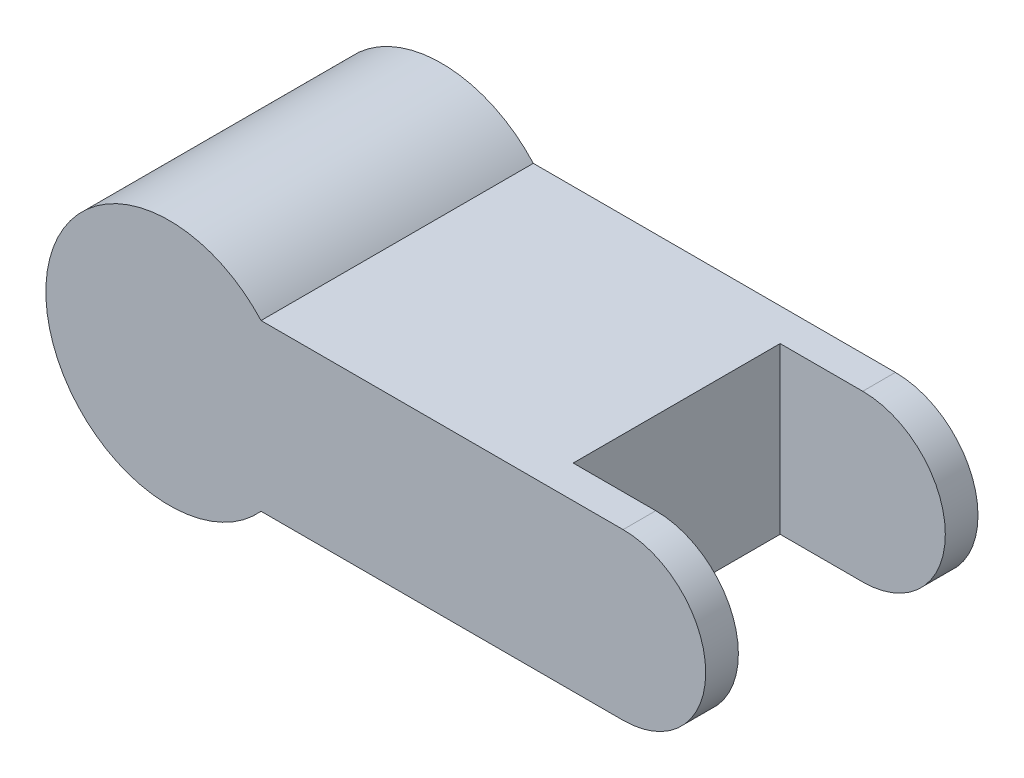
ISO-10303-21;
HEADER;
FILE_DESCRIPTION(('STEP AP214'),'2;1');
FILE_NAME('part.step','',(''),(''),'','','');
FILE_SCHEMA(('AUTOMOTIVE_DESIGN { 1 0 10303 214 1 1 1 1 }'));
ENDSEC;
DATA;
#1=APPLICATION_CONTEXT('core data for automotive mechanical design processes');
#2=APPLICATION_PROTOCOL_DEFINITION('international standard','automotive_design',2000,#1);
#3=PRODUCT_CONTEXT('',#1,'mechanical');
#4=PRODUCT('Part','Part','',(#3));
#5=PRODUCT_RELATED_PRODUCT_CATEGORY('part','',(#4));
#6=PRODUCT_DEFINITION_FORMATION('','',#4);
#7=PRODUCT_DEFINITION_CONTEXT('part definition',#1,'design');
#8=PRODUCT_DEFINITION('design','',#6,#7);
#9=PRODUCT_DEFINITION_SHAPE('','',#8);
#10=(LENGTH_UNIT() NAMED_UNIT(*) SI_UNIT(.MILLI.,.METRE.));
#11=(NAMED_UNIT(*) PLANE_ANGLE_UNIT() SI_UNIT($,.RADIAN.));
#12=(NAMED_UNIT(*) SI_UNIT($,.STERADIAN.) SOLID_ANGLE_UNIT());
#13=UNCERTAINTY_MEASURE_WITH_UNIT(LENGTH_MEASURE(1.E-05),#10,'distance_accuracy_value','');
#14=(GEOMETRIC_REPRESENTATION_CONTEXT(3) GLOBAL_UNCERTAINTY_ASSIGNED_CONTEXT((#13)) GLOBAL_UNIT_ASSIGNED_CONTEXT((#10,
#11,#12)) REPRESENTATION_CONTEXT('',''));
#15=CARTESIAN_POINT('',(0.,0.,0.));
#16=DIRECTION('',(0.,0.,1.));
#17=DIRECTION('',(1.,0.,0.));
#18=AXIS2_PLACEMENT_3D('',#15,#16,#17);
#19=CARTESIAN_POINT('',(250.,0.,-150.));
#20=DIRECTION('',(0.,0.,1.));
#21=DIRECTION('',(1.,0.,0.));
#22=AXIS2_PLACEMENT_3D('',#19,#20,#21);
#23=CYLINDRICAL_SURFACE('',#22,45.5);
#24=CARTESIAN_POINT('',(250.,0.,-132.));
#25=DIRECTION('',(0.,0.,-1.));
#26=DIRECTION('',(-1.,0.,0.));
#27=AXIS2_PLACEMENT_3D('',#24,#25,#26);
#28=CIRCLE('',#27,45.5);
#29=CARTESIAN_POINT('',(250.,-45.5,-132.));
#30=VERTEX_POINT('',#29);
#31=CARTESIAN_POINT('',(249.999999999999,45.5,-132.));
#32=VERTEX_POINT('',#31);
#33=EDGE_CURVE('E135',#30,#32,#28,.F.);
#34=ORIENTED_EDGE('',*,*,#33,.F.);
#35=DIRECTION('',(0.,0.,1.));
#36=VECTOR('',#35,1.);
#37=CARTESIAN_POINT('',(250.,-45.5,-150.));
#38=LINE('',#37,#36);
#39=CARTESIAN_POINT('',(250.,-45.5,-150.));
#40=VERTEX_POINT('',#39);
#41=EDGE_CURVE('E42',#40,#30,#38,.T.);
#42=ORIENTED_EDGE('',*,*,#41,.F.);
#43=CARTESIAN_POINT('',(250.,0.,-150.));
#44=DIRECTION('',(0.,0.,1.));
#45=DIRECTION('',(1.,0.,0.));
#46=AXIS2_PLACEMENT_3D('',#43,#44,#45);
#47=CIRCLE('',#46,45.5);
#48=CARTESIAN_POINT('',(249.999999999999,45.5,-150.));
#49=VERTEX_POINT('',#48);
#50=EDGE_CURVE('E138',#40,#49,#47,.T.);
#51=ORIENTED_EDGE('',*,*,#50,.T.);
#52=DIRECTION('',(0.,0.,1.));
#53=VECTOR('',#52,1.);
#54=CARTESIAN_POINT('',(249.999999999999,45.5,-150.));
#55=LINE('',#54,#53);
#56=EDGE_CURVE('E88',#49,#32,#55,.T.);
#57=ORIENTED_EDGE('',*,*,#56,.T.);
#58=EDGE_LOOP('',(#34,#42,#51,#57));
#59=FACE_BOUND('',#58,.T.);
#60=ADVANCED_FACE('F34',(#59),#23,.T.);
#61=CARTESIAN_POINT('',(250.,0.,-18.));
#62=DIRECTION('',(0.,0.,1.));
#63=DIRECTION('',(1.,0.,0.));
#64=AXIS2_PLACEMENT_3D('',#61,#62,#63);
#65=CIRCLE('',#64,45.5);
#66=CARTESIAN_POINT('',(249.999999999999,45.5,-18.));
#67=VERTEX_POINT('',#66);
#68=CARTESIAN_POINT('',(250.,-45.5,-18.));
#69=VERTEX_POINT('',#68);
#70=EDGE_CURVE('E131',#67,#69,#65,.F.);
#71=ORIENTED_EDGE('',*,*,#70,.F.);
#72=CARTESIAN_POINT('',(249.999999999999,45.5,0.));
#73=VERTEX_POINT('',#72);
#74=EDGE_CURVE('E148',#67,#73,#55,.T.);
#75=ORIENTED_EDGE('',*,*,#74,.T.);
#76=CARTESIAN_POINT('',(250.,0.,0.));
#77=DIRECTION('',(0.,0.,1.));
#78=DIRECTION('',(1.,0.,0.));
#79=AXIS2_PLACEMENT_3D('',#76,#77,#78);
#80=CIRCLE('',#79,45.5);
#81=CARTESIAN_POINT('',(250.,-45.5,0.));
#82=VERTEX_POINT('',#81);
#83=EDGE_CURVE('E137',#82,#73,#80,.T.);
#84=ORIENTED_EDGE('',*,*,#83,.F.);
#85=EDGE_CURVE('E80',#69,#82,#38,.T.);
#86=ORIENTED_EDGE('',*,*,#85,.F.);
#87=EDGE_LOOP('',(#71,#75,#84,#86));
#88=FACE_BOUND('',#87,.T.);
#89=ADVANCED_FACE('F36',(#88),#23,.T.);
#90=CARTESIAN_POINT('',(50.5346415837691,-45.5,-150.));
#91=DIRECTION('',(0.,-1.,0.));
#92=DIRECTION('',(1.,0.,0.));
#93=AXIS2_PLACEMENT_3D('',#90,#91,#92);
#94=PLANE('',#93);
#95=DIRECTION('',(-1.,0.,0.));
#96=VECTOR('',#95,1.);
#97=CARTESIAN_POINT('',(295.5,-45.5,-132.));
#98=LINE('',#97,#96);
#99=CARTESIAN_POINT('',(204.5,-45.5,-132.));
#100=VERTEX_POINT('',#99);
#101=EDGE_CURVE('E120',#30,#100,#98,.T.);
#102=ORIENTED_EDGE('',*,*,#101,.T.);
#103=DIRECTION('',(0.,0.,1.));
#104=VECTOR('',#103,1.);
#105=CARTESIAN_POINT('',(204.5,-45.5,-18.));
#106=LINE('',#105,#104);
#107=CARTESIAN_POINT('',(204.5,-45.5,-18.));
#108=VERTEX_POINT('',#107);
#109=EDGE_CURVE('E111',#100,#108,#106,.T.);
#110=ORIENTED_EDGE('',*,*,#109,.T.);
#111=DIRECTION('',(1.,0.,0.));
#112=VECTOR('',#111,1.);
#113=CARTESIAN_POINT('',(295.5,-45.5,-18.));
#114=LINE('',#113,#112);
#115=EDGE_CURVE('E130',#108,#69,#114,.T.);
#116=ORIENTED_EDGE('',*,*,#115,.T.);
#117=ORIENTED_EDGE('',*,*,#85,.T.);
#118=DIRECTION('',(1.,0.,0.));
#119=VECTOR('',#118,1.);
#120=CARTESIAN_POINT('',(50.5346415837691,-45.5,0.));
#121=LINE('',#120,#119);
#122=CARTESIAN_POINT('',(50.5346415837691,-45.5,0.));
#123=VERTEX_POINT('',#122);
#124=EDGE_CURVE('E141',#123,#82,#121,.T.);
#125=ORIENTED_EDGE('',*,*,#124,.F.);
#126=DIRECTION('',(0.,0.,1.));
#127=VECTOR('',#126,1.);
#128=CARTESIAN_POINT('',(50.5346415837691,-45.5,-150.));
#129=LINE('',#128,#127);
#130=CARTESIAN_POINT('',(50.5346415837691,-45.5,-150.));
#131=VERTEX_POINT('',#130);
#132=EDGE_CURVE('E160',#131,#123,#129,.T.);
#133=ORIENTED_EDGE('',*,*,#132,.F.);
#134=DIRECTION('',(1.,0.,0.));
#135=VECTOR('',#134,1.);
#136=CARTESIAN_POINT('',(50.5346415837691,-45.5,-150.));
#137=LINE('',#136,#135);
#138=EDGE_CURVE('E146',#131,#40,#137,.T.);
#139=ORIENTED_EDGE('',*,*,#138,.T.);
#140=ORIENTED_EDGE('',*,*,#41,.T.);
#141=EDGE_LOOP('',(#102,#110,#116,#117,#125,#133,#139,#140));
#142=FACE_BOUND('',#141,.T.);
#143=ADVANCED_FACE('F122',(#142),#94,.T.);
#144=CARTESIAN_POINT('',(0.,0.,-150.));
#145=DIRECTION('',(0.,0.,1.));
#146=DIRECTION('',(1.,0.,0.));
#147=AXIS2_PLACEMENT_3D('',#144,#145,#146);
#148=CYLINDRICAL_SURFACE('',#147,68.);
#149=CARTESIAN_POINT('',(0.,0.,0.));
#150=DIRECTION('',(0.,0.,1.));
#151=DIRECTION('',(1.,0.,0.));
#152=AXIS2_PLACEMENT_3D('',#149,#150,#151);
#153=CIRCLE('',#152,68.);
#154=CARTESIAN_POINT('',(50.5346415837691,45.5,0.));
#155=VERTEX_POINT('',#154);
#156=EDGE_CURVE('E154',#155,#123,#153,.T.);
#157=ORIENTED_EDGE('',*,*,#156,.F.);
#158=DIRECTION('',(0.,0.,1.));
#159=VECTOR('',#158,1.);
#160=CARTESIAN_POINT('',(50.5346415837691,45.5,-150.));
#161=LINE('',#160,#159);
#162=CARTESIAN_POINT('',(50.5346415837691,45.5,-150.));
#163=VERTEX_POINT('',#162);
#164=EDGE_CURVE('E162',#163,#155,#161,.T.);
#165=ORIENTED_EDGE('',*,*,#164,.F.);
#166=CARTESIAN_POINT('',(0.,0.,-150.));
#167=DIRECTION('',(0.,0.,1.));
#168=DIRECTION('',(1.,0.,0.));
#169=AXIS2_PLACEMENT_3D('',#166,#167,#168);
#170=CIRCLE('',#169,68.);
#171=EDGE_CURVE('E143',#163,#131,#170,.T.);
#172=ORIENTED_EDGE('',*,*,#171,.T.);
#173=ORIENTED_EDGE('',*,*,#132,.T.);
#174=EDGE_LOOP('',(#157,#165,#172,#173));
#175=FACE_BOUND('',#174,.T.);
#176=ADVANCED_FACE('F174',(#175),#148,.T.);
#177=CARTESIAN_POINT('',(50.5346415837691,45.5,-150.));
#178=DIRECTION('',(0.,1.,0.));
#179=DIRECTION('',(-1.,0.,0.));
#180=AXIS2_PLACEMENT_3D('',#177,#178,#179);
#181=PLANE('',#180);
#182=DIRECTION('',(-1.,0.,0.));
#183=VECTOR('',#182,1.);
#184=CARTESIAN_POINT('',(50.5346415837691,45.5,-132.));
#185=LINE('',#184,#183);
#186=CARTESIAN_POINT('',(204.5,45.5,-132.));
#187=VERTEX_POINT('',#186);
#188=EDGE_CURVE('E11',#32,#187,#185,.T.);
#189=ORIENTED_EDGE('',*,*,#188,.F.);
#190=ORIENTED_EDGE('',*,*,#56,.F.);
#191=DIRECTION('',(-1.,0.,0.));
#192=VECTOR('',#191,1.);
#193=CARTESIAN_POINT('',(50.5346415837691,45.5,-150.));
#194=LINE('',#193,#192);
#195=EDGE_CURVE('E140',#49,#163,#194,.T.);
#196=ORIENTED_EDGE('',*,*,#195,.T.);
#197=ORIENTED_EDGE('',*,*,#164,.T.);
#198=DIRECTION('',(-1.,0.,0.));
#199=VECTOR('',#198,1.);
#200=CARTESIAN_POINT('',(50.5346415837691,45.5,0.));
#201=LINE('',#200,#199);
#202=EDGE_CURVE('E151',#73,#155,#201,.T.);
#203=ORIENTED_EDGE('',*,*,#202,.F.);
#204=ORIENTED_EDGE('',*,*,#74,.F.);
#205=DIRECTION('',(1.,0.,0.));
#206=VECTOR('',#205,1.);
#207=CARTESIAN_POINT('',(295.5,45.5,-18.));
#208=LINE('',#207,#206);
#209=CARTESIAN_POINT('',(204.5,45.5,-18.));
#210=VERTEX_POINT('',#209);
#211=EDGE_CURVE('E124',#210,#67,#208,.T.);
#212=ORIENTED_EDGE('',*,*,#211,.F.);
#213=DIRECTION('',(0.,0.,1.));
#214=VECTOR('',#213,1.);
#215=CARTESIAN_POINT('',(204.5,45.5,-18.));
#216=LINE('',#215,#214);
#217=EDGE_CURVE('E49',#187,#210,#216,.T.);
#218=ORIENTED_EDGE('',*,*,#217,.F.);
#219=EDGE_LOOP('',(#189,#190,#196,#197,#203,#204,#212,#218));
#220=FACE_BOUND('',#219,.T.);
#221=ADVANCED_FACE('F167',(#220),#181,.T.);
#222=CARTESIAN_POINT('',(250.,0.,-150.));
#223=DIRECTION('',(0.,0.,1.));
#224=DIRECTION('',(1.,0.,0.));
#225=AXIS2_PLACEMENT_3D('',#222,#223,#224);
#226=PLANE('',#225);
#227=ORIENTED_EDGE('',*,*,#50,.F.);
#228=ORIENTED_EDGE('',*,*,#138,.F.);
#229=ORIENTED_EDGE('',*,*,#171,.F.);
#230=ORIENTED_EDGE('',*,*,#195,.F.);
#231=EDGE_LOOP('',(#227,#228,#229,#230));
#232=FACE_BOUND('',#231,.T.);
#233=ADVANCED_FACE('F176',(#232),#226,.F.);
#234=CARTESIAN_POINT('',(250.,0.,0.));
#235=DIRECTION('',(0.,0.,1.));
#236=DIRECTION('',(1.,0.,0.));
#237=AXIS2_PLACEMENT_3D('',#234,#235,#236);
#238=PLANE('',#237);
#239=ORIENTED_EDGE('',*,*,#83,.T.);
#240=ORIENTED_EDGE('',*,*,#202,.T.);
#241=ORIENTED_EDGE('',*,*,#156,.T.);
#242=ORIENTED_EDGE('',*,*,#124,.T.);
#243=EDGE_LOOP('',(#239,#240,#241,#242));
#244=FACE_BOUND('',#243,.T.);
#245=ADVANCED_FACE('F170',(#244),#238,.T.);
#246=CARTESIAN_POINT('',(295.5,-191.366377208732,-132.));
#247=DIRECTION('',(0.,0.,-1.));
#248=DIRECTION('',(-1.,0.,0.));
#249=AXIS2_PLACEMENT_3D('',#246,#247,#248);
#250=PLANE('',#249);
#251=ORIENTED_EDGE('',*,*,#33,.T.);
#252=ORIENTED_EDGE('',*,*,#188,.T.);
#253=DIRECTION('',(0.,1.,0.));
#254=VECTOR('',#253,1.);
#255=CARTESIAN_POINT('',(204.5,-191.366377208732,-132.));
#256=LINE('',#255,#254);
#257=EDGE_CURVE('E114',#100,#187,#256,.T.);
#258=ORIENTED_EDGE('',*,*,#257,.F.);
#259=ORIENTED_EDGE('',*,*,#101,.F.);
#260=EDGE_LOOP('',(#251,#252,#258,#259));
#261=FACE_BOUND('',#260,.T.);
#262=ADVANCED_FACE('F119',(#261),#250,.F.);
#263=CARTESIAN_POINT('',(204.5,-191.366377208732,-18.));
#264=DIRECTION('',(-1.,0.,0.));
#265=DIRECTION('',(0.,-1.,0.));
#266=AXIS2_PLACEMENT_3D('',#263,#264,#265);
#267=PLANE('',#266);
#268=ORIENTED_EDGE('',*,*,#257,.T.);
#269=ORIENTED_EDGE('',*,*,#217,.T.);
#270=DIRECTION('',(0.,1.,0.));
#271=VECTOR('',#270,1.);
#272=CARTESIAN_POINT('',(204.5,-191.366377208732,-18.));
#273=LINE('',#272,#271);
#274=EDGE_CURVE('E115',#108,#210,#273,.T.);
#275=ORIENTED_EDGE('',*,*,#274,.F.);
#276=ORIENTED_EDGE('',*,*,#109,.F.);
#277=EDGE_LOOP('',(#268,#269,#275,#276));
#278=FACE_BOUND('',#277,.T.);
#279=ADVANCED_FACE('F113',(#278),#267,.F.);
#280=CARTESIAN_POINT('',(295.5,-191.366377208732,-18.));
#281=DIRECTION('',(0.,0.,1.));
#282=DIRECTION('',(1.,0.,0.));
#283=AXIS2_PLACEMENT_3D('',#280,#281,#282);
#284=PLANE('',#283);
#285=ORIENTED_EDGE('',*,*,#70,.T.);
#286=ORIENTED_EDGE('',*,*,#115,.F.);
#287=ORIENTED_EDGE('',*,*,#274,.T.);
#288=ORIENTED_EDGE('',*,*,#211,.T.);
#289=EDGE_LOOP('',(#285,#286,#287,#288));
#290=FACE_BOUND('',#289,.T.);
#291=ADVANCED_FACE('F203',(#290),#284,.F.);
#292=CLOSED_SHELL('',(#60,#89,#143,#176,#221,#233,#245,#262,#279,#291));
#293=MANIFOLD_SOLID_BREP('B2',#292);
#294=ADVANCED_BREP_SHAPE_REPRESENTATION('',(#18,#293),#14);
#295=SHAPE_DEFINITION_REPRESENTATION(#9,#294);
ENDSEC;
END-ISO-10303-21;
